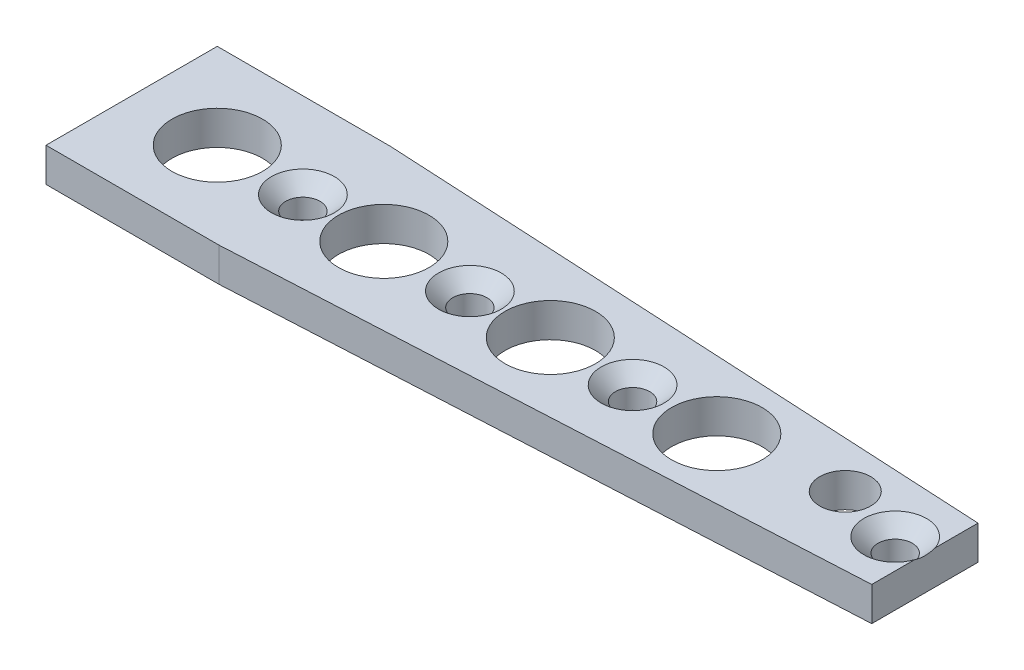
ISO-10303-21;
HEADER;
FILE_DESCRIPTION(('STEP AP214'),'2;1');
FILE_NAME('part.step','',(''),(''),'','','');
FILE_SCHEMA(('AUTOMOTIVE_DESIGN { 1 0 10303 214 1 1 1 1 }'));
ENDSEC;
DATA;
#1=APPLICATION_CONTEXT('core data for automotive mechanical design processes');
#2=APPLICATION_PROTOCOL_DEFINITION('international standard','automotive_design',2000,#1);
#3=PRODUCT_CONTEXT('',#1,'mechanical');
#4=PRODUCT('Part','Part','',(#3));
#5=PRODUCT_RELATED_PRODUCT_CATEGORY('part','',(#4));
#6=PRODUCT_DEFINITION_FORMATION('','',#4);
#7=PRODUCT_DEFINITION_CONTEXT('part definition',#1,'design');
#8=PRODUCT_DEFINITION('design','',#6,#7);
#9=PRODUCT_DEFINITION_SHAPE('','',#8);
#10=(LENGTH_UNIT() NAMED_UNIT(*) SI_UNIT(.MILLI.,.METRE.));
#11=(NAMED_UNIT(*) PLANE_ANGLE_UNIT() SI_UNIT($,.RADIAN.));
#12=(NAMED_UNIT(*) SI_UNIT($,.STERADIAN.) SOLID_ANGLE_UNIT());
#13=UNCERTAINTY_MEASURE_WITH_UNIT(LENGTH_MEASURE(1.E-05),#10,'distance_accuracy_value','');
#14=(GEOMETRIC_REPRESENTATION_CONTEXT(3) GLOBAL_UNCERTAINTY_ASSIGNED_CONTEXT((#13)) GLOBAL_UNIT_ASSIGNED_CONTEXT((#10,
#11,#12)) REPRESENTATION_CONTEXT('',''));
#15=CARTESIAN_POINT('',(0.,0.,0.));
#16=DIRECTION('',(0.,0.,1.));
#17=DIRECTION('',(1.,0.,0.));
#18=AXIS2_PLACEMENT_3D('',#15,#16,#17);
#19=CARTESIAN_POINT('',(55.58,2.38,-3.72217562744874));
#20=DIRECTION('',(-0.0523359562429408,0.,0.998629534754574));
#21=DIRECTION('',(0.998629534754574,0.,0.0523359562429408));
#22=AXIS2_PLACEMENT_3D('',#19,#20,#21);
#23=PLANE('',#22);
#24=DIRECTION('',(0.,1.,0.));
#25=VECTOR('',#24,1.);
#26=CARTESIAN_POINT('',(12.1165217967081,0.,-6.));
#27=LINE('',#26,#25);
#28=CARTESIAN_POINT('',(12.1165217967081,0.,-6.));
#29=VERTEX_POINT('',#28);
#30=CARTESIAN_POINT('',(12.1165217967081,2.38,-6.));
#31=VERTEX_POINT('',#30);
#32=EDGE_CURVE('E56',#29,#31,#27,.T.);
#33=ORIENTED_EDGE('',*,*,#32,.T.);
#34=DIRECTION('',(-0.998629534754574,0.,-0.0523359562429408));
#35=VECTOR('',#34,1.);
#36=CARTESIAN_POINT('',(55.58,2.38,-3.72217562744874));
#37=LINE('',#36,#35);
#38=CARTESIAN_POINT('',(55.58,2.38,-3.72217562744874));
#39=VERTEX_POINT('',#38);
#40=EDGE_CURVE('E154',#39,#31,#37,.T.);
#41=ORIENTED_EDGE('',*,*,#40,.F.);
#42=DIRECTION('',(0.,-1.,0.));
#43=VECTOR('',#42,1.);
#44=CARTESIAN_POINT('',(55.58,2.38,-3.72217562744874));
#45=LINE('',#44,#43);
#46=CARTESIAN_POINT('',(55.58,0.,-3.72217562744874));
#47=VERTEX_POINT('',#46);
#48=EDGE_CURVE('E130',#39,#47,#45,.T.);
#49=ORIENTED_EDGE('',*,*,#48,.T.);
#50=DIRECTION('',(-0.998629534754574,0.,-0.0523359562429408));
#51=VECTOR('',#50,1.);
#52=CARTESIAN_POINT('',(55.58,0.,-3.72217562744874));
#53=LINE('',#52,#51);
#54=EDGE_CURVE('E119',#47,#29,#53,.T.);
#55=ORIENTED_EDGE('',*,*,#54,.T.);
#56=EDGE_LOOP('',(#33,#41,#49,#55));
#57=FACE_BOUND('',#56,.T.);
#58=ADVANCED_FACE('F36',(#57),#23,.F.);
#59=CARTESIAN_POINT('',(0.,2.38,-6.635));
#60=DIRECTION('',(1.,0.,0.));
#61=DIRECTION('',(0.,0.,-1.));
#62=AXIS2_PLACEMENT_3D('',#59,#60,#61);
#63=PLANE('',#62);
#64=DIRECTION('',(0.,1.,0.));
#65=VECTOR('',#64,1.);
#66=CARTESIAN_POINT('',(0.,0.,-6.));
#67=LINE('',#66,#65);
#68=CARTESIAN_POINT('',(0.,0.,-6.));
#69=VERTEX_POINT('',#68);
#70=CARTESIAN_POINT('',(0.,2.38,-6.));
#71=VERTEX_POINT('',#70);
#72=EDGE_CURVE('E100',#69,#71,#67,.T.);
#73=ORIENTED_EDGE('',*,*,#72,.F.);
#74=DIRECTION('',(0.,0.,1.));
#75=VECTOR('',#74,1.);
#76=CARTESIAN_POINT('',(0.,0.,-6.635));
#77=LINE('',#76,#75);
#78=CARTESIAN_POINT('',(0.,0.,6.));
#79=VERTEX_POINT('',#78);
#80=EDGE_CURVE('E111',#69,#79,#77,.T.);
#81=ORIENTED_EDGE('',*,*,#80,.T.);
#82=DIRECTION('',(0.,1.,0.));
#83=VECTOR('',#82,1.);
#84=CARTESIAN_POINT('',(0.,0.,6.));
#85=LINE('',#84,#83);
#86=CARTESIAN_POINT('',(0.,2.38,6.));
#87=VERTEX_POINT('',#86);
#88=EDGE_CURVE('E64',#79,#87,#85,.T.);
#89=ORIENTED_EDGE('',*,*,#88,.T.);
#90=DIRECTION('',(0.,0.,1.));
#91=VECTOR('',#90,1.);
#92=CARTESIAN_POINT('',(0.,2.38,-6.635));
#93=LINE('',#92,#91);
#94=EDGE_CURVE('E113',#71,#87,#93,.T.);
#95=ORIENTED_EDGE('',*,*,#94,.F.);
#96=EDGE_LOOP('',(#73,#81,#89,#95));
#97=FACE_BOUND('',#96,.T.);
#98=ADVANCED_FACE('F110',(#97),#63,.F.);
#99=CARTESIAN_POINT('',(0.,2.38,6.635));
#100=DIRECTION('',(-0.0523359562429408,0.,-0.998629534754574));
#101=DIRECTION('',(-0.998629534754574,0.,0.0523359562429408));
#102=AXIS2_PLACEMENT_3D('',#99,#100,#101);
#103=PLANE('',#102);
#104=DIRECTION('',(0.,1.,0.));
#105=VECTOR('',#104,1.);
#106=CARTESIAN_POINT('',(12.1165217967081,0.,6.));
#107=LINE('',#106,#105);
#108=CARTESIAN_POINT('',(12.1165217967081,0.,6.));
#109=VERTEX_POINT('',#108);
#110=CARTESIAN_POINT('',(12.1165217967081,2.38,6.));
#111=VERTEX_POINT('',#110);
#112=EDGE_CURVE('E225',#109,#111,#107,.T.);
#113=ORIENTED_EDGE('',*,*,#112,.F.);
#114=DIRECTION('',(0.998629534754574,0.,-0.0523359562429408));
#115=VECTOR('',#114,1.);
#116=CARTESIAN_POINT('',(0.,0.,6.635));
#117=LINE('',#116,#115);
#118=CARTESIAN_POINT('',(55.58,0.,3.72217562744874));
#119=VERTEX_POINT('',#118);
#120=EDGE_CURVE('E118',#109,#119,#117,.T.);
#121=ORIENTED_EDGE('',*,*,#120,.T.);
#122=DIRECTION('',(0.,-1.,0.));
#123=VECTOR('',#122,1.);
#124=CARTESIAN_POINT('',(55.58,2.38,3.72217562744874));
#125=LINE('',#124,#123);
#126=CARTESIAN_POINT('',(55.58,2.38,3.72217562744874));
#127=VERTEX_POINT('',#126);
#128=EDGE_CURVE('E127',#127,#119,#125,.T.);
#129=ORIENTED_EDGE('',*,*,#128,.F.);
#130=DIRECTION('',(0.998629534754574,0.,-0.0523359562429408));
#131=VECTOR('',#130,1.);
#132=CARTESIAN_POINT('',(0.,2.38,6.635));
#133=LINE('',#132,#131);
#134=EDGE_CURVE('E131',#111,#127,#133,.T.);
#135=ORIENTED_EDGE('',*,*,#134,.F.);
#136=EDGE_LOOP('',(#113,#121,#129,#135));
#137=FACE_BOUND('',#136,.T.);
#138=ADVANCED_FACE('F149',(#137),#103,.F.);
#139=CARTESIAN_POINT('',(0.,2.38,0.));
#140=DIRECTION('',(0.,1.,0.));
#141=DIRECTION('',(0.,0.,1.));
#142=AXIS2_PLACEMENT_3D('',#139,#140,#141);
#143=PLANE('',#142);
#144=CARTESIAN_POINT('',(12.,2.38,0.));
#145=DIRECTION('',(0.,1.,0.));
#146=DIRECTION('',(0.,0.,1.));
#147=AXIS2_PLACEMENT_3D('',#144,#145,#146);
#148=CIRCLE('',#147,2.2);
#149=CARTESIAN_POINT('',(12.,2.38,2.2));
#150=VERTEX_POINT('',#149);
#151=EDGE_CURVE('E114',#150,#150,#148,.T.);
#152=ORIENTED_EDGE('',*,*,#151,.F.);
#153=EDGE_LOOP('',(#152));
#154=FACE_BOUND('',#153,.T.);
#155=CARTESIAN_POINT('',(23.7,2.38,0.));
#156=DIRECTION('',(0.,1.,0.));
#157=DIRECTION('',(0.,0.,1.));
#158=AXIS2_PLACEMENT_3D('',#155,#156,#157);
#159=CIRCLE('',#158,2.2);
#160=CARTESIAN_POINT('',(23.7,2.38,2.2));
#161=VERTEX_POINT('',#160);
#162=EDGE_CURVE('E213',#161,#161,#159,.T.);
#163=ORIENTED_EDGE('',*,*,#162,.F.);
#164=EDGE_LOOP('',(#163));
#165=FACE_BOUND('',#164,.T.);
#166=CARTESIAN_POINT('',(35.1,2.38,0.));
#167=DIRECTION('',(0.,1.,0.));
#168=DIRECTION('',(0.,0.,1.));
#169=AXIS2_PLACEMENT_3D('',#166,#167,#168);
#170=CIRCLE('',#169,2.2);
#171=CARTESIAN_POINT('',(35.1,2.38,2.2));
#172=VERTEX_POINT('',#171);
#173=EDGE_CURVE('E204',#172,#172,#170,.T.);
#174=ORIENTED_EDGE('',*,*,#173,.F.);
#175=EDGE_LOOP('',(#174));
#176=FACE_BOUND('',#175,.T.);
#177=CARTESIAN_POINT('',(49.,2.38,-1.));
#178=DIRECTION('',(0.,1.,0.));
#179=DIRECTION('',(0.,0.,1.));
#180=AXIS2_PLACEMENT_3D('',#177,#178,#179);
#181=CIRCLE('',#180,1.78600099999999);
#182=CARTESIAN_POINT('',(49.,2.38,0.786000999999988));
#183=VERTEX_POINT('',#182);
#184=EDGE_CURVE('E187',#183,#183,#181,.T.);
#185=ORIENTED_EDGE('',*,*,#184,.F.);
#186=EDGE_LOOP('',(#185));
#187=FACE_BOUND('',#186,.T.);
#188=CARTESIAN_POINT('',(17.667,2.38,0.));
#189=DIRECTION('',(0.,1.,0.));
#190=DIRECTION('',(0.,0.,1.));
#191=AXIS2_PLACEMENT_3D('',#188,#189,#190);
#192=CIRCLE('',#191,3.175);
#193=CARTESIAN_POINT('',(17.667,2.38,3.175));
#194=VERTEX_POINT('',#193);
#195=EDGE_CURVE('E176',#194,#194,#192,.T.);
#196=ORIENTED_EDGE('',*,*,#195,.F.);
#197=EDGE_LOOP('',(#196));
#198=FACE_BOUND('',#197,.T.);
#199=CARTESIAN_POINT('',(6.,2.38,0.));
#200=DIRECTION('',(0.,1.,0.));
#201=DIRECTION('',(0.,0.,1.));
#202=AXIS2_PLACEMENT_3D('',#199,#200,#201);
#203=CIRCLE('',#202,3.175);
#204=CARTESIAN_POINT('',(6.,2.38,3.175));
#205=VERTEX_POINT('',#204);
#206=EDGE_CURVE('E172',#205,#205,#203,.T.);
#207=ORIENTED_EDGE('',*,*,#206,.F.);
#208=EDGE_LOOP('',(#207));
#209=FACE_BOUND('',#208,.T.);
#210=CARTESIAN_POINT('',(29.334,2.38,0.));
#211=DIRECTION('',(0.,1.,0.));
#212=DIRECTION('',(0.,0.,1.));
#213=AXIS2_PLACEMENT_3D('',#210,#211,#212);
#214=CIRCLE('',#213,3.175);
#215=CARTESIAN_POINT('',(29.334,2.38,3.175));
#216=VERTEX_POINT('',#215);
#217=EDGE_CURVE('E137',#216,#216,#214,.T.);
#218=ORIENTED_EDGE('',*,*,#217,.F.);
#219=EDGE_LOOP('',(#218));
#220=FACE_BOUND('',#219,.T.);
#221=CARTESIAN_POINT('',(41.001,2.38,0.));
#222=DIRECTION('',(0.,1.,0.));
#223=DIRECTION('',(0.,0.,1.));
#224=AXIS2_PLACEMENT_3D('',#221,#222,#223);
#225=CIRCLE('',#224,3.175);
#226=CARTESIAN_POINT('',(41.001,2.38,3.175));
#227=VERTEX_POINT('',#226);
#228=EDGE_CURVE('E49',#227,#227,#225,.T.);
#229=ORIENTED_EDGE('',*,*,#228,.F.);
#230=EDGE_LOOP('',(#229));
#231=FACE_BOUND('',#230,.T.);
#232=ORIENTED_EDGE('',*,*,#40,.T.);
#233=DIRECTION('',(-1.,0.,0.));
#234=VECTOR('',#233,1.);
#235=CARTESIAN_POINT('',(0.,2.38,-6.));
#236=LINE('',#235,#234);
#237=EDGE_CURVE('E155',#31,#71,#236,.T.);
#238=ORIENTED_EDGE('',*,*,#237,.T.);
#239=ORIENTED_EDGE('',*,*,#94,.T.);
#240=DIRECTION('',(1.,0.,0.));
#241=VECTOR('',#240,1.);
#242=CARTESIAN_POINT('',(0.,2.38,6.));
#243=LINE('',#242,#241);
#244=EDGE_CURVE('E229',#87,#111,#243,.T.);
#245=ORIENTED_EDGE('',*,*,#244,.T.);
#246=ORIENTED_EDGE('',*,*,#134,.T.);
#247=DIRECTION('',(0.,0.,-1.));
#248=VECTOR('',#247,1.);
#249=CARTESIAN_POINT('',(55.58,2.38,-3.72217562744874));
#250=LINE('',#249,#248);
#251=CARTESIAN_POINT('',(55.58,2.38,0.716658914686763));
#252=VERTEX_POINT('',#251);
#253=EDGE_CURVE('E160',#127,#252,#250,.T.);
#254=ORIENTED_EDGE('',*,*,#253,.T.);
#255=CARTESIAN_POINT('',(53.5,2.38,0.));
#256=DIRECTION('',(0.,1.,0.));
#257=DIRECTION('',(0.,0.,1.));
#258=AXIS2_PLACEMENT_3D('',#255,#256,#257);
#259=CIRCLE('',#258,2.2);
#260=CARTESIAN_POINT('',(55.58,2.38,-0.716658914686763));
#261=VERTEX_POINT('',#260);
#262=EDGE_CURVE('E196',#261,#252,#259,.T.);
#263=ORIENTED_EDGE('',*,*,#262,.F.);
#264=EDGE_CURVE('E121',#261,#39,#250,.T.);
#265=ORIENTED_EDGE('',*,*,#264,.T.);
#266=EDGE_LOOP('',(#232,#238,#239,#245,#246,#254,#263,#265));
#267=FACE_BOUND('',#266,.T.);
#268=ADVANCED_FACE('F146',(#154,#165,#176,#187,#198,#209,#220,#231,#267),#143,.T.);
#269=CARTESIAN_POINT('',(0.,0.,0.));
#270=DIRECTION('',(0.,1.,0.));
#271=DIRECTION('',(0.,0.,1.));
#272=AXIS2_PLACEMENT_3D('',#269,#270,#271);
#273=PLANE('',#272);
#274=CARTESIAN_POINT('',(12.,0.,0.));
#275=DIRECTION('',(0.,1.,0.));
#276=DIRECTION('',(0.,0.,1.));
#277=AXIS2_PLACEMENT_3D('',#274,#275,#276);
#278=CIRCLE('',#277,1.2);
#279=CARTESIAN_POINT('',(12.,0.,1.2));
#280=VERTEX_POINT('',#279);
#281=EDGE_CURVE('E216',#280,#280,#278,.T.);
#282=ORIENTED_EDGE('',*,*,#281,.T.);
#283=EDGE_LOOP('',(#282));
#284=FACE_BOUND('',#283,.T.);
#285=CARTESIAN_POINT('',(23.7,0.,0.));
#286=DIRECTION('',(0.,1.,0.));
#287=DIRECTION('',(0.,0.,1.));
#288=AXIS2_PLACEMENT_3D('',#285,#286,#287);
#289=CIRCLE('',#288,1.2);
#290=CARTESIAN_POINT('',(23.7,0.,1.2));
#291=VERTEX_POINT('',#290);
#292=EDGE_CURVE('E207',#291,#291,#289,.T.);
#293=ORIENTED_EDGE('',*,*,#292,.T.);
#294=EDGE_LOOP('',(#293));
#295=FACE_BOUND('',#294,.T.);
#296=CARTESIAN_POINT('',(35.1,0.,0.));
#297=DIRECTION('',(0.,1.,0.));
#298=DIRECTION('',(0.,0.,1.));
#299=AXIS2_PLACEMENT_3D('',#296,#297,#298);
#300=CIRCLE('',#299,1.2);
#301=CARTESIAN_POINT('',(35.1,0.,1.2));
#302=VERTEX_POINT('',#301);
#303=EDGE_CURVE('E198',#302,#302,#300,.T.);
#304=ORIENTED_EDGE('',*,*,#303,.T.);
#305=EDGE_LOOP('',(#304));
#306=FACE_BOUND('',#305,.T.);
#307=CARTESIAN_POINT('',(53.5,0.,0.));
#308=DIRECTION('',(0.,1.,0.));
#309=DIRECTION('',(0.,0.,1.));
#310=AXIS2_PLACEMENT_3D('',#307,#308,#309);
#311=CIRCLE('',#310,1.2);
#312=CARTESIAN_POINT('',(53.5,0.,1.2));
#313=VERTEX_POINT('',#312);
#314=EDGE_CURVE('E190',#313,#313,#311,.T.);
#315=ORIENTED_EDGE('',*,*,#314,.T.);
#316=EDGE_LOOP('',(#315));
#317=FACE_BOUND('',#316,.T.);
#318=CARTESIAN_POINT('',(49.,0.,-1.));
#319=DIRECTION('',(0.,1.,0.));
#320=DIRECTION('',(0.,0.,1.));
#321=AXIS2_PLACEMENT_3D('',#318,#319,#320);
#322=CIRCLE('',#321,1.786001);
#323=CARTESIAN_POINT('',(49.,0.,0.786001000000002));
#324=VERTEX_POINT('',#323);
#325=EDGE_CURVE('E184',#324,#324,#322,.T.);
#326=ORIENTED_EDGE('',*,*,#325,.T.);
#327=EDGE_LOOP('',(#326));
#328=FACE_BOUND('',#327,.T.);
#329=CARTESIAN_POINT('',(17.667,0.,0.));
#330=DIRECTION('',(0.,1.,0.));
#331=DIRECTION('',(0.,0.,1.));
#332=AXIS2_PLACEMENT_3D('',#329,#330,#331);
#333=CIRCLE('',#332,3.175);
#334=CARTESIAN_POINT('',(17.667,0.,3.175));
#335=VERTEX_POINT('',#334);
#336=EDGE_CURVE('E181',#335,#335,#333,.T.);
#337=ORIENTED_EDGE('',*,*,#336,.T.);
#338=EDGE_LOOP('',(#337));
#339=FACE_BOUND('',#338,.T.);
#340=CARTESIAN_POINT('',(6.,0.,0.));
#341=DIRECTION('',(0.,1.,0.));
#342=DIRECTION('',(0.,0.,1.));
#343=AXIS2_PLACEMENT_3D('',#340,#341,#342);
#344=CIRCLE('',#343,3.175);
#345=CARTESIAN_POINT('',(6.,0.,3.175));
#346=VERTEX_POINT('',#345);
#347=EDGE_CURVE('E168',#346,#346,#344,.T.);
#348=ORIENTED_EDGE('',*,*,#347,.T.);
#349=EDGE_LOOP('',(#348));
#350=FACE_BOUND('',#349,.T.);
#351=CARTESIAN_POINT('',(29.334,0.,0.));
#352=DIRECTION('',(0.,1.,0.));
#353=DIRECTION('',(0.,0.,1.));
#354=AXIS2_PLACEMENT_3D('',#351,#352,#353);
#355=CIRCLE('',#354,3.175);
#356=CARTESIAN_POINT('',(29.334,0.,3.175));
#357=VERTEX_POINT('',#356);
#358=EDGE_CURVE('E134',#357,#357,#355,.T.);
#359=ORIENTED_EDGE('',*,*,#358,.T.);
#360=EDGE_LOOP('',(#359));
#361=FACE_BOUND('',#360,.T.);
#362=CARTESIAN_POINT('',(41.001,0.,0.));
#363=DIRECTION('',(0.,1.,0.));
#364=DIRECTION('',(0.,0.,1.));
#365=AXIS2_PLACEMENT_3D('',#362,#363,#364);
#366=CIRCLE('',#365,3.175);
#367=CARTESIAN_POINT('',(41.001,0.,3.175));
#368=VERTEX_POINT('',#367);
#369=EDGE_CURVE('E140',#368,#368,#366,.T.);
#370=ORIENTED_EDGE('',*,*,#369,.T.);
#371=EDGE_LOOP('',(#370));
#372=FACE_BOUND('',#371,.T.);
#373=DIRECTION('',(-1.,0.,0.));
#374=VECTOR('',#373,1.);
#375=CARTESIAN_POINT('',(0.,0.,-6.));
#376=LINE('',#375,#374);
#377=EDGE_CURVE('E97',#29,#69,#376,.T.);
#378=ORIENTED_EDGE('',*,*,#377,.F.);
#379=ORIENTED_EDGE('',*,*,#54,.F.);
#380=DIRECTION('',(0.,0.,-1.));
#381=VECTOR('',#380,1.);
#382=CARTESIAN_POINT('',(55.58,0.,-3.72217562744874));
#383=LINE('',#382,#381);
#384=EDGE_CURVE('E123',#119,#47,#383,.T.);
#385=ORIENTED_EDGE('',*,*,#384,.F.);
#386=ORIENTED_EDGE('',*,*,#120,.F.);
#387=DIRECTION('',(1.,0.,0.));
#388=VECTOR('',#387,1.);
#389=CARTESIAN_POINT('',(0.,0.,6.));
#390=LINE('',#389,#388);
#391=EDGE_CURVE('E105',#79,#109,#390,.T.);
#392=ORIENTED_EDGE('',*,*,#391,.F.);
#393=ORIENTED_EDGE('',*,*,#80,.F.);
#394=EDGE_LOOP('',(#378,#379,#385,#386,#392,#393));
#395=FACE_BOUND('',#394,.T.);
#396=ADVANCED_FACE('F116',(#284,#295,#306,#317,#328,#339,#350,#361,#372,#395),#273,.F.);
#397=CARTESIAN_POINT('',(55.58,2.38,-3.72217562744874));
#398=DIRECTION('',(-1.,0.,0.));
#399=DIRECTION('',(0.,0.,1.));
#400=AXIS2_PLACEMENT_3D('',#397,#398,#399);
#401=PLANE('',#400);
#402=ORIENTED_EDGE('',*,*,#264,.F.);
#403=CARTESIAN_POINT('',(55.58,7.09329746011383,-6.59297215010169));
#404=CARTESIAN_POINT('',(55.58,6.943753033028,-6.43614788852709));
#405=CARTESIAN_POINT('',(55.58,6.79444755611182,-6.2790946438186));
#406=CARTESIAN_POINT('',(55.58,6.49646034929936,-5.96438440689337));
#407=CARTESIAN_POINT('',(55.58,6.34777864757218,-5.80672738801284));
#408=CARTESIAN_POINT('',(55.58,6.05082284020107,-5.49027777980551));
#409=CARTESIAN_POINT('',(55.58,5.90255071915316,-5.33148332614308));
#410=CARTESIAN_POINT('',(55.58,5.60702543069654,-5.01295712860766));
#411=CARTESIAN_POINT('',(55.58,5.45977223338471,-4.85322541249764));
#412=CARTESIAN_POINT('',(55.58,5.14960518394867,-4.51396191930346));
#413=CARTESIAN_POINT('',(55.58,4.98685419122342,-4.33428087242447));
#414=CARTESIAN_POINT('',(55.58,4.66365580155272,-3.97282307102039));
#415=CARTESIAN_POINT('',(55.58,4.50320863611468,-3.7910461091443));
#416=CARTESIAN_POINT('',(55.58,4.1859236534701,-3.42482836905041));
#417=CARTESIAN_POINT('',(55.58,4.02908073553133,-3.24039204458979));
#418=CARTESIAN_POINT('',(55.58,3.79776457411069,-2.96049651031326));
#419=CARTESIAN_POINT('',(55.58,3.72132314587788,-2.86666541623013));
#420=CARTESIAN_POINT('',(55.58,3.57013155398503,-2.67765277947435));
#421=CARTESIAN_POINT('',(55.58,3.49538130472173,-2.58247130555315));
#422=CARTESIAN_POINT('',(55.58,3.36701068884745,-2.41510379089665));
#423=CARTESIAN_POINT('',(55.58,3.31289799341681,-2.34329587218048));
#424=CARTESIAN_POINT('',(55.58,3.20617109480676,-2.19856850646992));
#425=CARTESIAN_POINT('',(55.58,3.1535569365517,-2.12564902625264));
#426=CARTESIAN_POINT('',(55.58,3.0500958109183,-1.97833409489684));
#427=CARTESIAN_POINT('',(55.58,2.99925274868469,-1.90393588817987));
#428=CARTESIAN_POINT('',(55.58,2.89996029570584,-1.75356068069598));
#429=CARTESIAN_POINT('',(55.58,2.85151078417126,-1.67758375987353));
#430=CARTESIAN_POINT('',(55.58,2.75876059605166,-1.52550093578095));
#431=CARTESIAN_POINT('',(55.58,2.7143900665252,-1.44943830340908));
#432=CARTESIAN_POINT('',(55.58,2.62946213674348,-1.29522611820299));
#433=CARTESIAN_POINT('',(55.58,2.58890580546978,-1.21707598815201));
#434=CARTESIAN_POINT('',(55.58,2.47490638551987,-0.979520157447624));
#435=CARTESIAN_POINT('',(55.58,2.40866865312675,-0.816288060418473));
#436=CARTESIAN_POINT('',(55.58,2.34331352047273,-0.596613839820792));
#437=CARTESIAN_POINT('',(55.58,2.32947806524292,-0.544489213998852));
#438=CARTESIAN_POINT('',(55.58,2.30529333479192,-0.439416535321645));
#439=CARTESIAN_POINT('',(55.58,2.29494453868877,-0.386468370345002));
#440=CARTESIAN_POINT('',(55.58,2.27811730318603,-0.280082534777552));
#441=CARTESIAN_POINT('',(55.58,2.27162981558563,-0.226646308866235));
#442=CARTESIAN_POINT('',(55.58,2.2627410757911,-0.119435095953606));
#443=CARTESIAN_POINT('',(55.58,2.26033965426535,-0.0656601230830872));
#444=CARTESIAN_POINT('',(55.58,2.25966971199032,0.0521882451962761));
#445=CARTESIAN_POINT('',(55.58,2.26227739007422,0.116268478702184));
#446=CARTESIAN_POINT('',(55.58,2.27328736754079,0.243927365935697));
#447=CARTESIAN_POINT('',(55.58,2.28169057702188,0.3075059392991));
#448=CARTESIAN_POINT('',(55.58,2.30387296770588,0.433970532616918));
#449=CARTESIAN_POINT('',(55.58,2.31767373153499,0.496852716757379));
#450=CARTESIAN_POINT('',(55.58,2.3499978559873,0.621375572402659));
#451=CARTESIAN_POINT('',(55.58,2.36852157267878,0.683016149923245));
#452=CARTESIAN_POINT('',(55.58,2.43290112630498,0.874196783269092));
#453=CARTESIAN_POINT('',(55.58,2.48590276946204,1.00133008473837));
#454=CARTESIAN_POINT('',(55.58,2.60412985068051,1.24980491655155));
#455=CARTESIAN_POINT('',(55.58,2.66937805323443,1.37113512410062));
#456=CARTESIAN_POINT('',(55.58,2.77378774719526,1.55038944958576));
#457=CARTESIAN_POINT('',(55.58,2.80995699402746,1.61009169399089));
#458=CARTESIAN_POINT('',(55.58,2.88401654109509,1.72842199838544));
#459=CARTESIAN_POINT('',(55.58,2.92190688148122,1.78705003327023));
#460=CARTESIAN_POINT('',(55.58,2.99906190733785,1.90331226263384));
#461=CARTESIAN_POINT('',(55.58,3.03832528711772,1.9609473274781));
#462=CARTESIAN_POINT('',(55.58,3.11802408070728,2.075395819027));
#463=CARTESIAN_POINT('',(55.58,3.15845944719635,2.13220927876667));
#464=CARTESIAN_POINT('',(55.58,3.29403435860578,2.31925498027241));
#465=CARTESIAN_POINT('',(55.58,3.39129635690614,2.44794907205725));
#466=CARTESIAN_POINT('',(55.58,3.58938752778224,2.70257081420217));
#467=CARTESIAN_POINT('',(55.58,3.69021734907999,2.82849795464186));
#468=CARTESIAN_POINT('',(55.58,3.89447766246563,3.07833012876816));
#469=CARTESIAN_POINT('',(55.58,3.99790949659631,3.20223406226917));
#470=CARTESIAN_POINT('',(55.58,4.20665496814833,3.44844948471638));
#471=CARTESIAN_POINT('',(55.58,4.31196867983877,3.57076091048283));
#472=CARTESIAN_POINT('',(55.58,4.52427878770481,3.81443855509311));
#473=CARTESIAN_POINT('',(55.58,4.63127866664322,3.93580173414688));
#474=CARTESIAN_POINT('',(55.58,4.84639090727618,4.17753903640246));
#475=CARTESIAN_POINT('',(55.58,4.95450328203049,4.29791314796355));
#476=CARTESIAN_POINT('',(55.58,5.28007231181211,4.65777366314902));
#477=CARTESIAN_POINT('',(55.58,5.498832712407,4.89608000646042));
#478=CARTESIAN_POINT('',(55.58,5.91200486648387,5.34186644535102));
#479=CARTESIAN_POINT('',(55.58,6.10615884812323,5.5495864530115));
#480=CARTESIAN_POINT('',(55.58,6.49576410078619,5.96384385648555));
#481=CARTESIAN_POINT('',(55.58,6.69121549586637,6.17038113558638));
#482=CARTESIAN_POINT('',(55.58,7.08217911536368,6.58162086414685));
#483=CARTESIAN_POINT('',(55.58,7.27768706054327,6.78632738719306));
#484=CARTESIAN_POINT('',(55.58,7.66941405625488,7.19501443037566));
#485=CARTESIAN_POINT('',(55.58,7.86563302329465,7.39899503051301));
#486=CARTESIAN_POINT('',(55.58,8.06211582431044,7.60271989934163));
#487=B_SPLINE_CURVE_WITH_KNOTS('',3,(#403,#404,#405,#406,#407,#408,#409,#410,#411,#412,#413,
#414,#415,#416,#417,#418,#419,#420,#421,#422,#423,#424,#425,#426,#427,#428,#429,#430,#431,#432,
#433,#434,#435,#436,#437,#438,#439,#440,#441,#442,#443,#444,#445,#446,#447,#448,#449,#450,#451,
#452,#453,#454,#455,#456,#457,#458,#459,#460,#461,#462,#463,#464,#465,#466,#467,#468,#469,#470,
#471,#472,#473,#474,#475,#476,#477,#478,#479,#480,#481,#482,#483,#484,#485,#486),.UNSPECIFIED.,
.F.,.F.,(4,2,2,2,2,2,2,2,2,2,2,2,2,2,2,2,2,2,2,2,2,2,2,2,2,2,2,2,2,2,2,2,2,2,2,2,2,2,2,2,2,4),
(0.,0.650090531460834,1.30021011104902,1.95197543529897,2.60372154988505,3.33100168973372,
4.05835440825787,4.78460499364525,5.14767253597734,5.51072165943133,5.78044885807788,
6.05018413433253,6.32048069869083,6.59076360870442,6.85482162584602,7.11895342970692,
7.64465361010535,7.80634792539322,7.96806445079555,8.12940051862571,8.29072990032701,
8.48284790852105,8.67499609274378,8.86792058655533,9.06085962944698,9.47296042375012,
9.88583497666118,10.0952219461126,10.3046138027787,10.5138116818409,10.7230011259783,
11.206835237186,11.6907577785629,12.1749352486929,12.6591318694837,13.1445115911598,
13.6298970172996,14.6003413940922,15.4533251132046,16.3063916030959,17.1555970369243,
18.0047057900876),.UNSPECIFIED.);
#488=EDGE_CURVE('E12',#261,#252,#487,.T.);
#489=ORIENTED_EDGE('',*,*,#488,.T.);
#490=ORIENTED_EDGE('',*,*,#253,.F.);
#491=ORIENTED_EDGE('',*,*,#128,.T.);
#492=ORIENTED_EDGE('',*,*,#384,.T.);
#493=ORIENTED_EDGE('',*,*,#48,.F.);
#494=EDGE_LOOP('',(#402,#489,#490,#491,#492,#493));
#495=FACE_BOUND('',#494,.T.);
#496=ADVANCED_FACE('F237',(#495),#401,.F.);
#497=CARTESIAN_POINT('',(6.,2.38,0.));
#498=DIRECTION('',(0.,1.,0.));
#499=DIRECTION('',(0.,0.,1.));
#500=AXIS2_PLACEMENT_3D('',#497,#498,#499);
#501=CYLINDRICAL_SURFACE('',#500,3.175);
#502=ORIENTED_EDGE('',*,*,#347,.F.);
#503=EDGE_LOOP('',(#502));
#504=FACE_BOUND('',#503,.T.);
#505=ORIENTED_EDGE('',*,*,#206,.T.);
#506=EDGE_LOOP('',(#505));
#507=FACE_BOUND('',#506,.T.);
#508=ADVANCED_FACE('F266',(#504,#507),#501,.F.);
#509=CARTESIAN_POINT('',(17.667,2.38,0.));
#510=DIRECTION('',(0.,1.,0.));
#511=DIRECTION('',(0.,0.,1.));
#512=AXIS2_PLACEMENT_3D('',#509,#510,#511);
#513=CYLINDRICAL_SURFACE('',#512,3.175);
#514=ORIENTED_EDGE('',*,*,#336,.F.);
#515=EDGE_LOOP('',(#514));
#516=FACE_BOUND('',#515,.T.);
#517=ORIENTED_EDGE('',*,*,#195,.T.);
#518=EDGE_LOOP('',(#517));
#519=FACE_BOUND('',#518,.T.);
#520=ADVANCED_FACE('F269',(#516,#519),#513,.F.);
#521=CARTESIAN_POINT('',(29.334,2.38,0.));
#522=DIRECTION('',(0.,1.,0.));
#523=DIRECTION('',(0.,0.,1.));
#524=AXIS2_PLACEMENT_3D('',#521,#522,#523);
#525=CYLINDRICAL_SURFACE('',#524,3.175);
#526=ORIENTED_EDGE('',*,*,#358,.F.);
#527=EDGE_LOOP('',(#526));
#528=FACE_BOUND('',#527,.T.);
#529=ORIENTED_EDGE('',*,*,#217,.T.);
#530=EDGE_LOOP('',(#529));
#531=FACE_BOUND('',#530,.T.);
#532=ADVANCED_FACE('F267',(#528,#531),#525,.F.);
#533=CARTESIAN_POINT('',(41.001,2.38,0.));
#534=DIRECTION('',(0.,1.,0.));
#535=DIRECTION('',(0.,0.,1.));
#536=AXIS2_PLACEMENT_3D('',#533,#534,#535);
#537=CYLINDRICAL_SURFACE('',#536,3.175);
#538=ORIENTED_EDGE('',*,*,#369,.F.);
#539=EDGE_LOOP('',(#538));
#540=FACE_BOUND('',#539,.T.);
#541=ORIENTED_EDGE('',*,*,#228,.T.);
#542=EDGE_LOOP('',(#541));
#543=FACE_BOUND('',#542,.T.);
#544=ADVANCED_FACE('F38',(#540,#543),#537,.F.);
#545=CARTESIAN_POINT('',(49.,2.38,-1.));
#546=DIRECTION('',(0.,1.,0.));
#547=DIRECTION('',(0.,0.,1.));
#548=AXIS2_PLACEMENT_3D('',#545,#546,#547);
#549=CYLINDRICAL_SURFACE('',#548,1.786001);
#550=ORIENTED_EDGE('',*,*,#325,.F.);
#551=EDGE_LOOP('',(#550));
#552=FACE_BOUND('',#551,.T.);
#553=ORIENTED_EDGE('',*,*,#184,.T.);
#554=EDGE_LOOP('',(#553));
#555=FACE_BOUND('',#554,.T.);
#556=ADVANCED_FACE('F243',(#552,#555),#549,.F.);
#557=CARTESIAN_POINT('',(53.5,2.38,0.));
#558=DIRECTION('',(0.,1.,0.));
#559=DIRECTION('',(0.,0.,1.));
#560=AXIS2_PLACEMENT_3D('',#557,#558,#559);
#561=CONICAL_SURFACE('',#560,2.2,0.785398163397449);
#562=CARTESIAN_POINT('',(53.5,1.38,0.));
#563=DIRECTION('',(0.,1.,0.));
#564=DIRECTION('',(0.,0.,1.));
#565=AXIS2_PLACEMENT_3D('',#562,#563,#564);
#566=CIRCLE('',#565,1.2);
#567=CARTESIAN_POINT('',(53.5,1.38,1.2));
#568=VERTEX_POINT('',#567);
#569=EDGE_CURVE('E193',#568,#568,#566,.T.);
#570=ORIENTED_EDGE('',*,*,#569,.F.);
#571=EDGE_LOOP('',(#570));
#572=FACE_BOUND('',#571,.T.);
#573=ORIENTED_EDGE('',*,*,#262,.T.);
#574=ORIENTED_EDGE('',*,*,#488,.F.);
#575=EDGE_LOOP('',(#573,#574));
#576=FACE_BOUND('',#575,.T.);
#577=ADVANCED_FACE('F240',(#572,#576),#561,.F.);
#578=CARTESIAN_POINT('',(53.5,2.38,0.));
#579=DIRECTION('',(0.,1.,0.));
#580=DIRECTION('',(0.,0.,1.));
#581=AXIS2_PLACEMENT_3D('',#578,#579,#580);
#582=CYLINDRICAL_SURFACE('',#581,1.2);
#583=ORIENTED_EDGE('',*,*,#314,.F.);
#584=EDGE_LOOP('',(#583));
#585=FACE_BOUND('',#584,.T.);
#586=ORIENTED_EDGE('',*,*,#569,.T.);
#587=EDGE_LOOP('',(#586));
#588=FACE_BOUND('',#587,.T.);
#589=ADVANCED_FACE('F242',(#585,#588),#582,.F.);
#590=CARTESIAN_POINT('',(35.1,2.38,0.));
#591=DIRECTION('',(0.,1.,0.));
#592=DIRECTION('',(0.,0.,1.));
#593=AXIS2_PLACEMENT_3D('',#590,#591,#592);
#594=CYLINDRICAL_SURFACE('',#593,1.2);
#595=ORIENTED_EDGE('',*,*,#303,.F.);
#596=EDGE_LOOP('',(#595));
#597=FACE_BOUND('',#596,.T.);
#598=CARTESIAN_POINT('',(35.1,1.38,0.));
#599=DIRECTION('',(0.,1.,0.));
#600=DIRECTION('',(0.,0.,1.));
#601=AXIS2_PLACEMENT_3D('',#598,#599,#600);
#602=CIRCLE('',#601,1.2);
#603=CARTESIAN_POINT('',(35.1,1.38,1.2));
#604=VERTEX_POINT('',#603);
#605=EDGE_CURVE('E201',#604,#604,#602,.T.);
#606=ORIENTED_EDGE('',*,*,#605,.T.);
#607=EDGE_LOOP('',(#606));
#608=FACE_BOUND('',#607,.T.);
#609=ADVANCED_FACE('F249',(#597,#608),#594,.F.);
#610=CARTESIAN_POINT('',(35.1,2.38,0.));
#611=DIRECTION('',(0.,1.,0.));
#612=DIRECTION('',(0.,0.,1.));
#613=AXIS2_PLACEMENT_3D('',#610,#611,#612);
#614=CONICAL_SURFACE('',#613,2.2,0.785398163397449);
#615=ORIENTED_EDGE('',*,*,#605,.F.);
#616=EDGE_LOOP('',(#615));
#617=FACE_BOUND('',#616,.T.);
#618=ORIENTED_EDGE('',*,*,#173,.T.);
#619=EDGE_LOOP('',(#618));
#620=FACE_BOUND('',#619,.T.);
#621=ADVANCED_FACE('F343',(#617,#620),#614,.F.);
#622=CARTESIAN_POINT('',(23.7,2.38,0.));
#623=DIRECTION('',(0.,1.,0.));
#624=DIRECTION('',(0.,0.,1.));
#625=AXIS2_PLACEMENT_3D('',#622,#623,#624);
#626=CYLINDRICAL_SURFACE('',#625,1.2);
#627=ORIENTED_EDGE('',*,*,#292,.F.);
#628=EDGE_LOOP('',(#627));
#629=FACE_BOUND('',#628,.T.);
#630=CARTESIAN_POINT('',(23.7,1.38,0.));
#631=DIRECTION('',(0.,1.,0.));
#632=DIRECTION('',(0.,0.,1.));
#633=AXIS2_PLACEMENT_3D('',#630,#631,#632);
#634=CIRCLE('',#633,1.2);
#635=CARTESIAN_POINT('',(23.7,1.38,1.2));
#636=VERTEX_POINT('',#635);
#637=EDGE_CURVE('E210',#636,#636,#634,.T.);
#638=ORIENTED_EDGE('',*,*,#637,.T.);
#639=EDGE_LOOP('',(#638));
#640=FACE_BOUND('',#639,.T.);
#641=ADVANCED_FACE('F339',(#629,#640),#626,.F.);
#642=CARTESIAN_POINT('',(23.7,2.38,0.));
#643=DIRECTION('',(0.,1.,0.));
#644=DIRECTION('',(0.,0.,1.));
#645=AXIS2_PLACEMENT_3D('',#642,#643,#644);
#646=CONICAL_SURFACE('',#645,2.2,0.785398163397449);
#647=ORIENTED_EDGE('',*,*,#637,.F.);
#648=EDGE_LOOP('',(#647));
#649=FACE_BOUND('',#648,.T.);
#650=ORIENTED_EDGE('',*,*,#162,.T.);
#651=EDGE_LOOP('',(#650));
#652=FACE_BOUND('',#651,.T.);
#653=ADVANCED_FACE('F335',(#649,#652),#646,.F.);
#654=CARTESIAN_POINT('',(12.,2.38,0.));
#655=DIRECTION('',(0.,1.,0.));
#656=DIRECTION('',(0.,0.,1.));
#657=AXIS2_PLACEMENT_3D('',#654,#655,#656);
#658=CYLINDRICAL_SURFACE('',#657,1.2);
#659=ORIENTED_EDGE('',*,*,#281,.F.);
#660=EDGE_LOOP('',(#659));
#661=FACE_BOUND('',#660,.T.);
#662=CARTESIAN_POINT('',(12.,1.38,0.));
#663=DIRECTION('',(0.,1.,0.));
#664=DIRECTION('',(0.,0.,1.));
#665=AXIS2_PLACEMENT_3D('',#662,#663,#664);
#666=CIRCLE('',#665,1.2);
#667=CARTESIAN_POINT('',(12.,1.38,1.2));
#668=VERTEX_POINT('',#667);
#669=EDGE_CURVE('E219',#668,#668,#666,.T.);
#670=ORIENTED_EDGE('',*,*,#669,.T.);
#671=EDGE_LOOP('',(#670));
#672=FACE_BOUND('',#671,.T.);
#673=ADVANCED_FACE('F331',(#661,#672),#658,.F.);
#674=CARTESIAN_POINT('',(12.,2.38,0.));
#675=DIRECTION('',(0.,1.,0.));
#676=DIRECTION('',(0.,0.,1.));
#677=AXIS2_PLACEMENT_3D('',#674,#675,#676);
#678=CONICAL_SURFACE('',#677,2.2,0.785398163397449);
#679=ORIENTED_EDGE('',*,*,#669,.F.);
#680=EDGE_LOOP('',(#679));
#681=FACE_BOUND('',#680,.T.);
#682=ORIENTED_EDGE('',*,*,#151,.T.);
#683=EDGE_LOOP('',(#682));
#684=FACE_BOUND('',#683,.T.);
#685=ADVANCED_FACE('F315',(#681,#684),#678,.F.);
#686=CARTESIAN_POINT('',(0.,0.,6.));
#687=DIRECTION('',(0.,0.,1.));
#688=DIRECTION('',(1.,0.,0.));
#689=AXIS2_PLACEMENT_3D('',#686,#687,#688);
#690=PLANE('',#689);
#691=ORIENTED_EDGE('',*,*,#244,.F.);
#692=ORIENTED_EDGE('',*,*,#88,.F.);
#693=ORIENTED_EDGE('',*,*,#391,.T.);
#694=ORIENTED_EDGE('',*,*,#112,.T.);
#695=EDGE_LOOP('',(#691,#692,#693,#694));
#696=FACE_BOUND('',#695,.T.);
#697=ADVANCED_FACE('F233',(#696),#690,.T.);
#698=CARTESIAN_POINT('',(0.,0.,-6.));
#699=DIRECTION('',(0.,0.,-1.));
#700=DIRECTION('',(-1.,0.,0.));
#701=AXIS2_PLACEMENT_3D('',#698,#699,#700);
#702=PLANE('',#701);
#703=ORIENTED_EDGE('',*,*,#237,.F.);
#704=ORIENTED_EDGE('',*,*,#32,.F.);
#705=ORIENTED_EDGE('',*,*,#377,.T.);
#706=ORIENTED_EDGE('',*,*,#72,.T.);
#707=EDGE_LOOP('',(#703,#704,#705,#706));
#708=FACE_BOUND('',#707,.T.);
#709=ADVANCED_FACE('F99',(#708),#702,.T.);
#710=CLOSED_SHELL('',(#58,#98,#138,#268,#396,#496,#508,#520,#532,#544,#556,#577,#589,#609,#621,
#641,#653,#673,#685,#697,#709));
#711=MANIFOLD_SOLID_BREP('B2',#710);
#712=ADVANCED_BREP_SHAPE_REPRESENTATION('',(#18,#711),#14);
#713=SHAPE_DEFINITION_REPRESENTATION(#9,#712);
ENDSEC;
END-ISO-10303-21;
